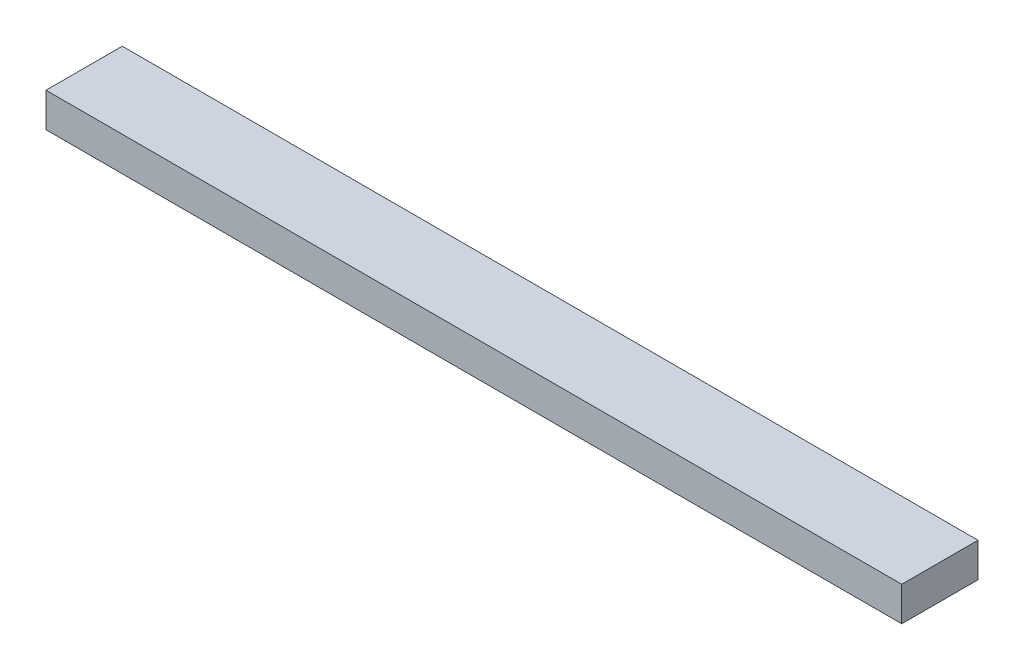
ISO-10303-21;
HEADER;
FILE_DESCRIPTION(('STEP AP214'),'2;1');
FILE_NAME('part.step','',(''),(''),'','','');
FILE_SCHEMA(('AUTOMOTIVE_DESIGN { 1 0 10303 214 1 1 1 1 }'));
ENDSEC;
DATA;
#1=APPLICATION_CONTEXT('core data for automotive mechanical design processes');
#2=APPLICATION_PROTOCOL_DEFINITION('international standard','automotive_design',2000,#1);
#3=PRODUCT_CONTEXT('',#1,'mechanical');
#4=PRODUCT('Part','Part','',(#3));
#5=PRODUCT_RELATED_PRODUCT_CATEGORY('part','',(#4));
#6=PRODUCT_DEFINITION_FORMATION('','',#4);
#7=PRODUCT_DEFINITION_CONTEXT('part definition',#1,'design');
#8=PRODUCT_DEFINITION('design','',#6,#7);
#9=PRODUCT_DEFINITION_SHAPE('','',#8);
#10=(LENGTH_UNIT() NAMED_UNIT(*) SI_UNIT(.MILLI.,.METRE.));
#11=(NAMED_UNIT(*) PLANE_ANGLE_UNIT() SI_UNIT($,.RADIAN.));
#12=(NAMED_UNIT(*) SI_UNIT($,.STERADIAN.) SOLID_ANGLE_UNIT());
#13=UNCERTAINTY_MEASURE_WITH_UNIT(LENGTH_MEASURE(1.E-05),#10,'distance_accuracy_value','');
#14=(GEOMETRIC_REPRESENTATION_CONTEXT(3) GLOBAL_UNCERTAINTY_ASSIGNED_CONTEXT((#13)) GLOBAL_UNIT_ASSIGNED_CONTEXT((#10,
#11,#12)) REPRESENTATION_CONTEXT('',''));
#15=CARTESIAN_POINT('',(0.,0.,0.));
#16=DIRECTION('',(0.,0.,1.));
#17=DIRECTION('',(1.,0.,0.));
#18=AXIS2_PLACEMENT_3D('',#15,#16,#17);
#19=CARTESIAN_POINT('',(450.,5.97969526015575,25.1991930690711));
#20=DIRECTION('',(0.,0.,-1.));
#21=DIRECTION('',(-1.,0.,0.));
#22=AXIS2_PLACEMENT_3D('',#19,#20,#21);
#23=PLANE('',#22);
#24=DIRECTION('',(0.,-1.,0.));
#25=VECTOR('',#24,1.);
#26=CARTESIAN_POINT('',(0.,5.97969526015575,25.1991930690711));
#27=LINE('',#26,#25);
#28=CARTESIAN_POINT('',(0.,5.97969526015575,25.1991930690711));
#29=VERTEX_POINT('',#28);
#30=CARTESIAN_POINT('',(0.,-12.0203047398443,25.1991930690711));
#31=VERTEX_POINT('',#30);
#32=EDGE_CURVE('E101',#29,#31,#27,.T.);
#33=ORIENTED_EDGE('',*,*,#32,.T.);
#34=DIRECTION('',(-1.,0.,0.));
#35=VECTOR('',#34,1.);
#36=CARTESIAN_POINT('',(450.,-12.0203047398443,25.1991930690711));
#37=LINE('',#36,#35);
#38=CARTESIAN_POINT('',(450.,-12.0203047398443,25.1991930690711));
#39=VERTEX_POINT('',#38);
#40=EDGE_CURVE('E12',#39,#31,#37,.T.);
#41=ORIENTED_EDGE('',*,*,#40,.F.);
#42=DIRECTION('',(0.,-1.,0.));
#43=VECTOR('',#42,1.);
#44=CARTESIAN_POINT('',(450.,5.97969526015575,25.1991930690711));
#45=LINE('',#44,#43);
#46=CARTESIAN_POINT('',(450.,5.97969526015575,25.1991930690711));
#47=VERTEX_POINT('',#46);
#48=EDGE_CURVE('E87',#47,#39,#45,.T.);
#49=ORIENTED_EDGE('',*,*,#48,.F.);
#50=DIRECTION('',(-1.,0.,0.));
#51=VECTOR('',#50,1.);
#52=CARTESIAN_POINT('',(450.,5.97969526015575,25.1991930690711));
#53=LINE('',#52,#51);
#54=EDGE_CURVE('E96',#47,#29,#53,.T.);
#55=ORIENTED_EDGE('',*,*,#54,.T.);
#56=EDGE_LOOP('',(#33,#41,#49,#55));
#57=FACE_BOUND('',#56,.T.);
#58=ADVANCED_FACE('F36',(#57),#23,.F.);
#59=CARTESIAN_POINT('',(450.,-12.0203047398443,25.1991930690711));
#60=DIRECTION('',(0.,1.,0.));
#61=DIRECTION('',(0.,0.,1.));
#62=AXIS2_PLACEMENT_3D('',#59,#60,#61);
#63=PLANE('',#62);
#64=DIRECTION('',(0.,0.,-1.));
#65=VECTOR('',#64,1.);
#66=CARTESIAN_POINT('',(0.,-12.0203047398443,25.1991930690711));
#67=LINE('',#66,#65);
#68=CARTESIAN_POINT('',(0.,-12.0203047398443,-14.9008069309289));
#69=VERTEX_POINT('',#68);
#70=EDGE_CURVE('E91',#31,#69,#67,.T.);
#71=ORIENTED_EDGE('',*,*,#70,.T.);
#72=DIRECTION('',(-1.,0.,0.));
#73=VECTOR('',#72,1.);
#74=CARTESIAN_POINT('',(450.,-12.0203047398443,-14.9008069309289));
#75=LINE('',#74,#73);
#76=CARTESIAN_POINT('',(450.,-12.0203047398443,-14.9008069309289));
#77=VERTEX_POINT('',#76);
#78=EDGE_CURVE('E44',#77,#69,#75,.T.);
#79=ORIENTED_EDGE('',*,*,#78,.F.);
#80=DIRECTION('',(0.,0.,-1.));
#81=VECTOR('',#80,1.);
#82=CARTESIAN_POINT('',(450.,-12.0203047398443,25.1991930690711));
#83=LINE('',#82,#81);
#84=EDGE_CURVE('E82',#39,#77,#83,.T.);
#85=ORIENTED_EDGE('',*,*,#84,.F.);
#86=ORIENTED_EDGE('',*,*,#40,.T.);
#87=EDGE_LOOP('',(#71,#79,#85,#86));
#88=FACE_BOUND('',#87,.T.);
#89=ADVANCED_FACE('F90',(#88),#63,.F.);
#90=CARTESIAN_POINT('',(450.,5.97969526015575,-14.9008069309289));
#91=DIRECTION('',(0.,0.,1.));
#92=DIRECTION('',(1.,0.,0.));
#93=AXIS2_PLACEMENT_3D('',#90,#91,#92);
#94=PLANE('',#93);
#95=DIRECTION('',(0.,1.,0.));
#96=VECTOR('',#95,1.);
#97=CARTESIAN_POINT('',(0.,5.97969526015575,-14.9008069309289));
#98=LINE('',#97,#96);
#99=CARTESIAN_POINT('',(0.,5.97969526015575,-14.9008069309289));
#100=VERTEX_POINT('',#99);
#101=EDGE_CURVE('E69',#69,#100,#98,.T.);
#102=ORIENTED_EDGE('',*,*,#101,.T.);
#103=DIRECTION('',(-1.,0.,0.));
#104=VECTOR('',#103,1.);
#105=CARTESIAN_POINT('',(450.,5.97969526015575,-14.9008069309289));
#106=LINE('',#105,#104);
#107=CARTESIAN_POINT('',(450.,5.97969526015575,-14.9008069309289));
#108=VERTEX_POINT('',#107);
#109=EDGE_CURVE('E92',#108,#100,#106,.T.);
#110=ORIENTED_EDGE('',*,*,#109,.F.);
#111=DIRECTION('',(0.,1.,0.));
#112=VECTOR('',#111,1.);
#113=CARTESIAN_POINT('',(450.,5.97969526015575,-14.9008069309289));
#114=LINE('',#113,#112);
#115=EDGE_CURVE('E85',#77,#108,#114,.T.);
#116=ORIENTED_EDGE('',*,*,#115,.F.);
#117=ORIENTED_EDGE('',*,*,#78,.T.);
#118=EDGE_LOOP('',(#102,#110,#116,#117));
#119=FACE_BOUND('',#118,.T.);
#120=ADVANCED_FACE('F93',(#119),#94,.F.);
#121=CARTESIAN_POINT('',(450.,5.97969526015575,25.1991930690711));
#122=DIRECTION('',(0.,-1.,0.));
#123=DIRECTION('',(0.,0.,-1.));
#124=AXIS2_PLACEMENT_3D('',#121,#122,#123);
#125=PLANE('',#124);
#126=DIRECTION('',(0.,0.,1.));
#127=VECTOR('',#126,1.);
#128=CARTESIAN_POINT('',(0.,5.97969526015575,25.1991930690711));
#129=LINE('',#128,#127);
#130=EDGE_CURVE('E75',#100,#29,#129,.T.);
#131=ORIENTED_EDGE('',*,*,#130,.T.);
#132=ORIENTED_EDGE('',*,*,#54,.F.);
#133=DIRECTION('',(0.,0.,1.));
#134=VECTOR('',#133,1.);
#135=CARTESIAN_POINT('',(450.,5.97969526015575,25.1991930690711));
#136=LINE('',#135,#134);
#137=EDGE_CURVE('E52',#108,#47,#136,.T.);
#138=ORIENTED_EDGE('',*,*,#137,.F.);
#139=ORIENTED_EDGE('',*,*,#109,.T.);
#140=EDGE_LOOP('',(#131,#132,#138,#139));
#141=FACE_BOUND('',#140,.T.);
#142=ADVANCED_FACE('F113',(#141),#125,.F.);
#143=CARTESIAN_POINT('',(450.,0.,0.));
#144=DIRECTION('',(1.,0.,0.));
#145=DIRECTION('',(0.,0.,-1.));
#146=AXIS2_PLACEMENT_3D('',#143,#144,#145);
#147=PLANE('',#146);
#148=ORIENTED_EDGE('',*,*,#48,.T.);
#149=ORIENTED_EDGE('',*,*,#84,.T.);
#150=ORIENTED_EDGE('',*,*,#115,.T.);
#151=ORIENTED_EDGE('',*,*,#137,.T.);
#152=EDGE_LOOP('',(#148,#149,#150,#151));
#153=FACE_BOUND('',#152,.T.);
#154=ADVANCED_FACE('F83',(#153),#147,.T.);
#155=CARTESIAN_POINT('',(0.,0.,0.));
#156=DIRECTION('',(1.,0.,0.));
#157=DIRECTION('',(0.,0.,-1.));
#158=AXIS2_PLACEMENT_3D('',#155,#156,#157);
#159=PLANE('',#158);
#160=ORIENTED_EDGE('',*,*,#32,.F.);
#161=ORIENTED_EDGE('',*,*,#130,.F.);
#162=ORIENTED_EDGE('',*,*,#101,.F.);
#163=ORIENTED_EDGE('',*,*,#70,.F.);
#164=EDGE_LOOP('',(#160,#161,#162,#163));
#165=FACE_BOUND('',#164,.T.);
#166=ADVANCED_FACE('F116',(#165),#159,.F.);
#167=CLOSED_SHELL('',(#58,#89,#120,#142,#154,#166));
#168=MANIFOLD_SOLID_BREP('B2',#167);
#169=ADVANCED_BREP_SHAPE_REPRESENTATION('',(#18,#168),#14);
#170=SHAPE_DEFINITION_REPRESENTATION(#9,#169);
ENDSEC;
END-ISO-10303-21;
